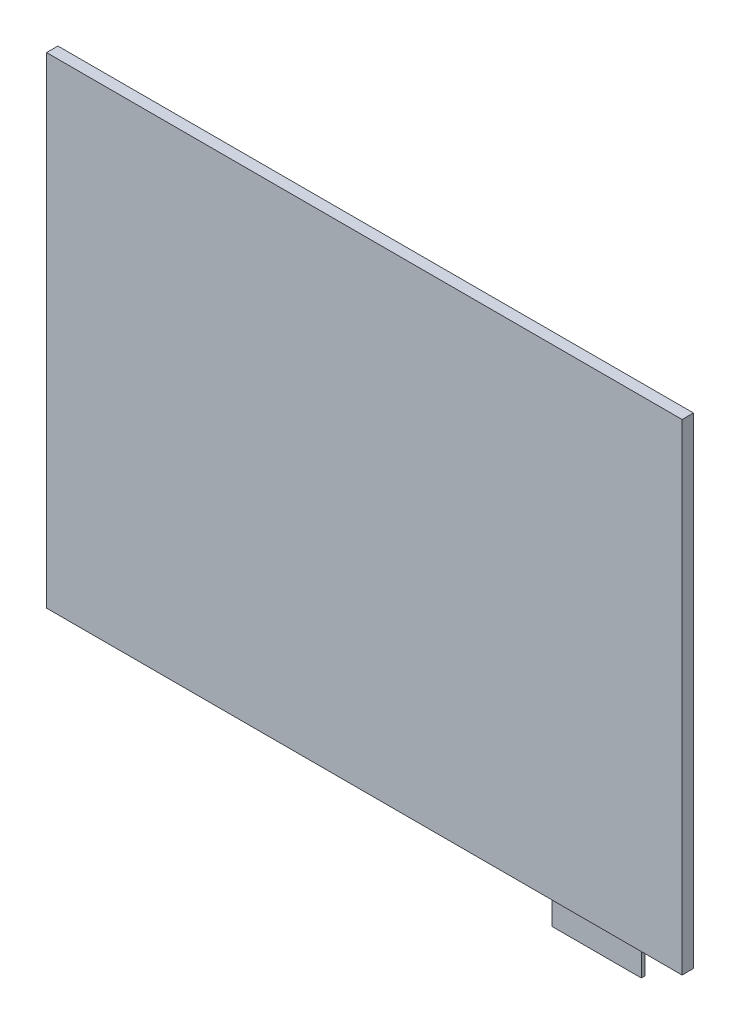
from build123d import *

# Parameters (mm, degrees)
SKETCH2_W          = 355.439537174
SKETCH2_H          = 269.0806171
BASE_EXTRUDE_DEPTH = 6.35
SKETCH3_W          = 2
SKETCH3_H          = 50
CONNECTOR_DEPTH    = 15


with BuildPart() as part:
    # Sketch2 → Base-Extrude (new body)
    with BuildSketch(Plane.XY):
        Rectangle(SKETCH2_W, SKETCH2_H)
    extrude(amount=BASE_EXTRUDE_DEPTH)

    # Sketch3 → Connector (add)
    with BuildSketch(Plane(origin=(43.179460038, -134.54030855, 0), x_dir=(0, 0, -1), z_dir=(0, 1, 0))):
        with Locations((-3.175, -84.54030855)):
            Rectangle(SKETCH3_W, SKETCH3_H)
    extrude(amount=-CONNECTOR_DEPTH)


solid = part.part
